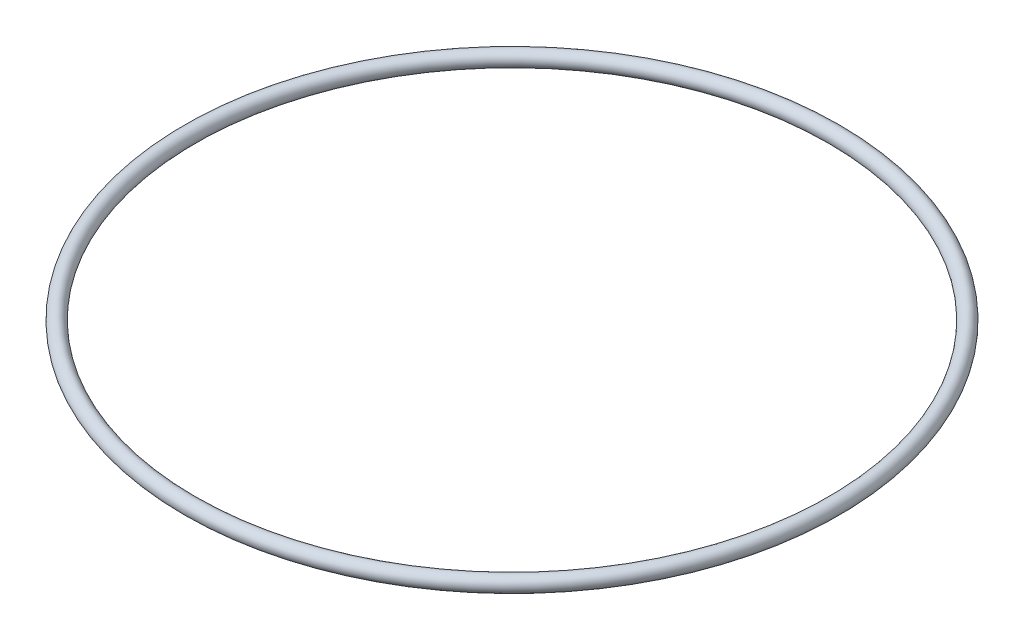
ISO-10303-21;
HEADER;
FILE_DESCRIPTION(('STEP AP214'),'2;1');
FILE_NAME('part.step','',(''),(''),'','','');
FILE_SCHEMA(('AUTOMOTIVE_DESIGN { 1 0 10303 214 1 1 1 1 }'));
ENDSEC;
DATA;
#1=APPLICATION_CONTEXT('core data for automotive mechanical design processes');
#2=APPLICATION_PROTOCOL_DEFINITION('international standard','automotive_design',2000,#1);
#3=PRODUCT_CONTEXT('',#1,'mechanical');
#4=PRODUCT('Part','Part','',(#3));
#5=PRODUCT_RELATED_PRODUCT_CATEGORY('part','',(#4));
#6=PRODUCT_DEFINITION_FORMATION('','',#4);
#7=PRODUCT_DEFINITION_CONTEXT('part definition',#1,'design');
#8=PRODUCT_DEFINITION('design','',#6,#7);
#9=PRODUCT_DEFINITION_SHAPE('','',#8);
#10=(LENGTH_UNIT() NAMED_UNIT(*) SI_UNIT(.MILLI.,.METRE.));
#11=(NAMED_UNIT(*) PLANE_ANGLE_UNIT() SI_UNIT($,.RADIAN.));
#12=(NAMED_UNIT(*) SI_UNIT($,.STERADIAN.) SOLID_ANGLE_UNIT());
#13=UNCERTAINTY_MEASURE_WITH_UNIT(LENGTH_MEASURE(1.E-05),#10,'distance_accuracy_value','');
#14=(GEOMETRIC_REPRESENTATION_CONTEXT(3) GLOBAL_UNCERTAINTY_ASSIGNED_CONTEXT((#13)) GLOBAL_UNIT_ASSIGNED_CONTEXT((#10,
#11,#12)) REPRESENTATION_CONTEXT('',''));
#15=CARTESIAN_POINT('',(0.,0.,0.));
#16=DIRECTION('',(0.,0.,1.));
#17=DIRECTION('',(1.,0.,0.));
#18=AXIS2_PLACEMENT_3D('',#15,#16,#17);
#19=CARTESIAN_POINT('',(0.,0.,0.));
#20=DIRECTION('',(0.,1.,0.));
#21=DIRECTION('',(0.,0.,1.));
#22=AXIS2_PLACEMENT_3D('',#19,#20,#21);
#23=TOROIDAL_SURFACE('',#22,64.,1.5);
#24=CARTESIAN_POINT('',(0.,0.,65.5));
#25=VERTEX_POINT('',#24);
#26=VERTEX_LOOP('',#25);
#27=FACE_BOUND('',#26,.T.);
#28=ADVANCED_FACE('F33',(#27),#23,.T.);
#29=CLOSED_SHELL('',(#28));
#30=MANIFOLD_SOLID_BREP('B2',#29);
#31=ADVANCED_BREP_SHAPE_REPRESENTATION('',(#18,#30),#14);
#32=SHAPE_DEFINITION_REPRESENTATION(#9,#31);
ENDSEC;
END-ISO-10303-21;
